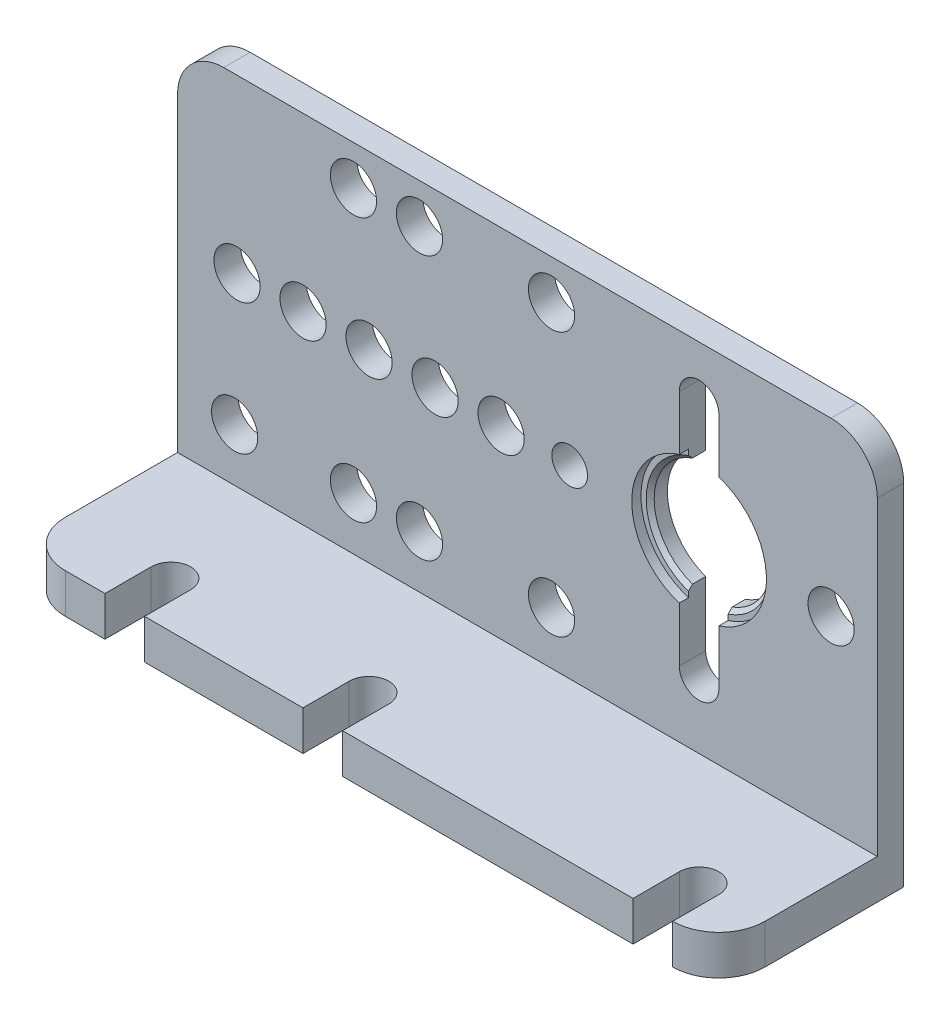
from build123d import *

# Parameters (mm, degrees)
EXTRUSION1_DEPTH        = 26.5
CONG_1_R                = 3.5
ENL_V_MAT_EXTRU_1_DEPTH = 41.339186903
ESQUISSE4_R             = 1.75
ESQUISSE4_R_2           = 1.35
ENL_V_MAT_EXTRU_2_DEPTH = 42.788156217
ESQUISSE5_R             = 5.1
ENL_V_MAT_EXTRU_3_DEPTH = 0.7
CHANFREIN1_SIZE         = 0.3


with BuildPart() as part:
    # Esquisse1 → Extrusion1 (new, symmetric)
    with BuildSketch(Plane(origin=(0, 0, 0), x_dir=(0, 0, -1), z_dir=(1, 0, 0))):
        Polygon((0, 0), (-14, 0), (-14, 3), (-2, 3), (-2, 30), (0, 30), align=None)
    extrude(amount=EXTRUSION1_DEPTH, both=True)

    # Cong_1
    cong_1_edges = [part.edges().sort_by_distance(p)[0] for p in [
        (26.5, 1.5, 14),
        (-26.5, 1.5, 14),
        (26.5, 30, 1),
        (-26.5, 30, 1),
    ]]
    fillet(cong_1_edges, radius=CONG_1_R)

    # Esquisse3 → Enl_v. mat.-Extru.1 (cut, through all)
    with BuildSketch(Plane(origin=(0, 3, 0), x_dir=(1, 0, 0), z_dir=(0, 1, 0))):
        with BuildLine():
            Line((-2, -14), (-2, -10.5))
            ThreePointArc((-2, -10.5), (-3.5, -9), (-5, -10.5))
            Line((-5, -10.5), (-5, -14))
            Line((-5, -14), (-2, -14))
        make_face()
        with BuildLine():
            Line((-20, -14), (-17, -14))
            Line((-17, -14), (-17, -10.5))
            ThreePointArc((-17, -10.5), (-18.5, -9), (-20, -10.5))
            Line((-20, -10.5), (-20, -14))
        make_face()
        with BuildLine():
            Line((23, -14), (23, -10.5))
            ThreePointArc((23, -10.5), (21.5, -9), (20, -10.5))
            Line((20, -10.5), (20, -14))
            Line((20, -14), (23, -14))
        make_face()
    extrude(amount=-ENL_V_MAT_EXTRU_1_DEPTH, mode=Mode.SUBTRACT)

    # Esquisse4 → Enl_v. mat.-Extru.2 (cut, through all)
    with BuildSketch(Plane.XY.offset(2)):
        with Locations((1.825397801, 27)):
            Circle(ESQUISSE4_R)
        with Locations((-1.995723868, 17)):
            Circle(ESQUISSE4_R)
        with Locations((1.825397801, 7)):
            Circle(ESQUISSE4_R)
        with Locations((-8.174602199, 27)):
            Circle(ESQUISSE4_R)
        with Locations((-8.174602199, 7)):
            Circle(ESQUISSE4_R)
        with Locations((-6.995723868, 17)):
            Circle(ESQUISSE4_R)
        with Locations((-11.995723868, 17)):
            Circle(ESQUISSE4_R)
        with Locations((23, 17)):
            Circle(ESQUISSE4_R)
        with Locations((-16.995723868, 17)):
            Circle(ESQUISSE4_R)
        with Locations((-21.995723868, 17)):
            Circle(ESQUISSE4_R)
        with Locations((-13.174602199, 27)):
            Circle(ESQUISSE4_R)
        with Locations((-13.174602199, 7)):
            Circle(ESQUISSE4_R)
        with Locations((-22.174602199, 7)):
            Circle(ESQUISSE4_R)
        with Locations((3.2, 17)):
            Circle(ESQUISSE4_R_2)
        with BuildLine():
            Line((11.5, 12.863576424), (11.5, 8))
            ThreePointArc((11.5, 8), (13, 6.5), (14.5, 8))
            Line((14.5, 8), (14.5, 12.863576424))
            ThreePointArc((14.5, 12.863576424), (17.4, 17), (14.5, 21.136423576))
            Line((14.5, 21.136423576), (14.5, 26))
            ThreePointArc((14.5, 26), (13, 27.5), (11.5, 26))
            Line((11.5, 26), (11.5, 21.136423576))
            ThreePointArc((11.5, 21.136423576), (8.6, 17), (11.5, 12.863576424))
        make_face()
    extrude(amount=-ENL_V_MAT_EXTRU_2_DEPTH, mode=Mode.SUBTRACT)

    # Esquisse5 → Enl_v. mat.-Extru.3 (cut)
    with BuildSketch(Plane.XY.offset(2)):
        with Locations((13, 17)):
            Circle(ESQUISSE5_R)
    extrude(amount=-ENL_V_MAT_EXTRU_3_DEPTH, mode=Mode.SUBTRACT)

    # Chanfrein1
    chanfrein1_edges = [part.edges().sort_by_distance(p)[0] for p in [
        (17.4, 17, 1.3),
        (8.6, 17, 1.3),
    ]]
    chamfer(chanfrein1_edges, length=CHANFREIN1_SIZE)


solid = part.part
